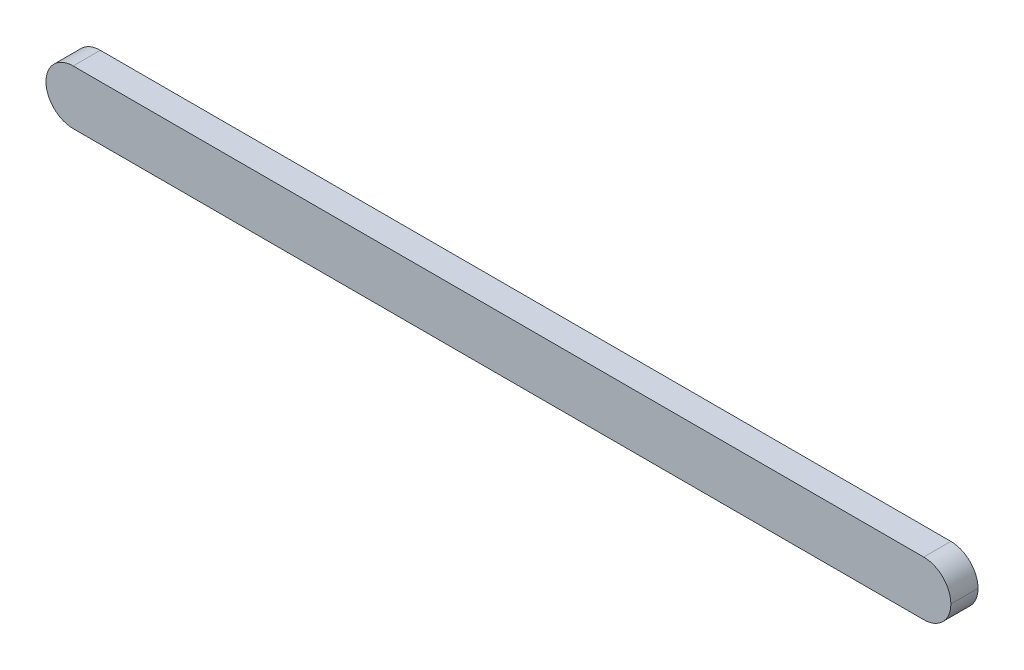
ISO-10303-21;
HEADER;
FILE_DESCRIPTION(('STEP AP214'),'2;1');
FILE_NAME('part.step','',(''),(''),'','','');
FILE_SCHEMA(('AUTOMOTIVE_DESIGN { 1 0 10303 214 1 1 1 1 }'));
ENDSEC;
DATA;
#1=APPLICATION_CONTEXT('core data for automotive mechanical design processes');
#2=APPLICATION_PROTOCOL_DEFINITION('international standard','automotive_design',2000,#1);
#3=PRODUCT_CONTEXT('',#1,'mechanical');
#4=PRODUCT('Part','Part','',(#3));
#5=PRODUCT_RELATED_PRODUCT_CATEGORY('part','',(#4));
#6=PRODUCT_DEFINITION_FORMATION('','',#4);
#7=PRODUCT_DEFINITION_CONTEXT('part definition',#1,'design');
#8=PRODUCT_DEFINITION('design','',#6,#7);
#9=PRODUCT_DEFINITION_SHAPE('','',#8);
#10=(LENGTH_UNIT() NAMED_UNIT(*) SI_UNIT(.MILLI.,.METRE.));
#11=(NAMED_UNIT(*) PLANE_ANGLE_UNIT() SI_UNIT($,.RADIAN.));
#12=(NAMED_UNIT(*) SI_UNIT($,.STERADIAN.) SOLID_ANGLE_UNIT());
#13=UNCERTAINTY_MEASURE_WITH_UNIT(LENGTH_MEASURE(1.E-05),#10,'distance_accuracy_value','');
#14=(GEOMETRIC_REPRESENTATION_CONTEXT(3) GLOBAL_UNCERTAINTY_ASSIGNED_CONTEXT((#13)) GLOBAL_UNIT_ASSIGNED_CONTEXT((#10,
#11,#12)) REPRESENTATION_CONTEXT('',''));
#15=CARTESIAN_POINT('',(0.,0.,0.));
#16=DIRECTION('',(0.,0.,1.));
#17=DIRECTION('',(1.,0.,0.));
#18=AXIS2_PLACEMENT_3D('',#15,#16,#17);
#19=CARTESIAN_POINT('',(0.,0.,3.));
#20=DIRECTION('',(0.,1.,0.));
#21=DIRECTION('',(0.,0.,1.));
#22=AXIS2_PLACEMENT_3D('',#19,#20,#21);
#23=PLANE('',#22);
#24=DIRECTION('',(1.,0.,0.));
#25=VECTOR('',#24,1.);
#26=CARTESIAN_POINT('',(0.,0.,0.));
#27=LINE('',#26,#25);
#28=CARTESIAN_POINT('',(3.,0.,0.));
#29=VERTEX_POINT('',#28);
#30=CARTESIAN_POINT('',(97.,0.,0.));
#31=VERTEX_POINT('',#30);
#32=EDGE_CURVE('E90',#29,#31,#27,.T.);
#33=ORIENTED_EDGE('',*,*,#32,.T.);
#34=DIRECTION('',(0.,0.,-1.));
#35=VECTOR('',#34,1.);
#36=CARTESIAN_POINT('',(97.,0.,3.));
#37=LINE('',#36,#35);
#38=CARTESIAN_POINT('',(97.,0.,3.));
#39=VERTEX_POINT('',#38);
#40=EDGE_CURVE('E111',#31,#39,#37,.F.);
#41=ORIENTED_EDGE('',*,*,#40,.T.);
#42=DIRECTION('',(1.,0.,0.));
#43=VECTOR('',#42,1.);
#44=CARTESIAN_POINT('',(0.,0.,3.));
#45=LINE('',#44,#43);
#46=CARTESIAN_POINT('',(3.,0.,3.));
#47=VERTEX_POINT('',#46);
#48=EDGE_CURVE('E124',#47,#39,#45,.T.);
#49=ORIENTED_EDGE('',*,*,#48,.F.);
#50=DIRECTION('',(0.,0.,-1.));
#51=VECTOR('',#50,1.);
#52=CARTESIAN_POINT('',(3.,0.,3.));
#53=LINE('',#52,#51);
#54=EDGE_CURVE('E109',#47,#29,#53,.T.);
#55=ORIENTED_EDGE('',*,*,#54,.T.);
#56=EDGE_LOOP('',(#33,#41,#49,#55));
#57=FACE_BOUND('',#56,.T.);
#58=ADVANCED_FACE('F29',(#57),#23,.F.);
#59=CARTESIAN_POINT('',(0.,6.,3.));
#60=DIRECTION('',(0.,-1.,0.));
#61=DIRECTION('',(0.,0.,-1.));
#62=AXIS2_PLACEMENT_3D('',#59,#60,#61);
#63=PLANE('',#62);
#64=DIRECTION('',(-1.,0.,0.));
#65=VECTOR('',#64,1.);
#66=CARTESIAN_POINT('',(0.,6.,3.));
#67=LINE('',#66,#65);
#68=CARTESIAN_POINT('',(97.,6.,3.));
#69=VERTEX_POINT('',#68);
#70=CARTESIAN_POINT('',(3.,6.,3.));
#71=VERTEX_POINT('',#70);
#72=EDGE_CURVE('E93',#69,#71,#67,.T.);
#73=ORIENTED_EDGE('',*,*,#72,.F.);
#74=DIRECTION('',(0.,0.,-1.));
#75=VECTOR('',#74,1.);
#76=CARTESIAN_POINT('',(97.,6.,3.));
#77=LINE('',#76,#75);
#78=CARTESIAN_POINT('',(97.,6.,0.));
#79=VERTEX_POINT('',#78);
#80=EDGE_CURVE('E11',#69,#79,#77,.T.);
#81=ORIENTED_EDGE('',*,*,#80,.T.);
#82=DIRECTION('',(-1.,0.,0.));
#83=VECTOR('',#82,1.);
#84=CARTESIAN_POINT('',(0.,6.,0.));
#85=LINE('',#84,#83);
#86=CARTESIAN_POINT('',(3.,6.,0.));
#87=VERTEX_POINT('',#86);
#88=EDGE_CURVE('E121',#79,#87,#85,.T.);
#89=ORIENTED_EDGE('',*,*,#88,.T.);
#90=DIRECTION('',(0.,0.,-1.));
#91=VECTOR('',#90,1.);
#92=CARTESIAN_POINT('',(3.,6.,3.));
#93=LINE('',#92,#91);
#94=EDGE_CURVE('E36',#87,#71,#93,.F.);
#95=ORIENTED_EDGE('',*,*,#94,.T.);
#96=EDGE_LOOP('',(#73,#81,#89,#95));
#97=FACE_BOUND('',#96,.T.);
#98=ADVANCED_FACE('F119',(#97),#63,.F.);
#99=CARTESIAN_POINT('',(0.,6.,3.));
#100=DIRECTION('',(0.,0.,-1.));
#101=DIRECTION('',(-1.,0.,0.));
#102=AXIS2_PLACEMENT_3D('',#99,#100,#101);
#103=PLANE('',#102);
#104=ORIENTED_EDGE('',*,*,#48,.T.);
#105=CARTESIAN_POINT('',(97.,3.,3.));
#106=DIRECTION('',(0.,0.,-1.));
#107=DIRECTION('',(-1.,0.,0.));
#108=AXIS2_PLACEMENT_3D('',#105,#106,#107);
#109=CIRCLE('',#108,3.);
#110=CARTESIAN_POINT('',(100.,3.,3.));
#111=VERTEX_POINT('',#110);
#112=EDGE_CURVE('E117',#39,#111,#109,.F.);
#113=ORIENTED_EDGE('',*,*,#112,.T.);
#114=CARTESIAN_POINT('',(97.,3.,3.));
#115=DIRECTION('',(0.,0.,-1.));
#116=DIRECTION('',(-1.,0.,0.));
#117=AXIS2_PLACEMENT_3D('',#114,#115,#116);
#118=CIRCLE('',#117,3.);
#119=EDGE_CURVE('E51',#111,#69,#118,.F.);
#120=ORIENTED_EDGE('',*,*,#119,.T.);
#121=ORIENTED_EDGE('',*,*,#72,.T.);
#122=CARTESIAN_POINT('',(3.,3.,3.));
#123=DIRECTION('',(0.,0.,-1.));
#124=DIRECTION('',(-1.,0.,0.));
#125=AXIS2_PLACEMENT_3D('',#122,#123,#124);
#126=CIRCLE('',#125,3.);
#127=CARTESIAN_POINT('',(0.,3.,3.));
#128=VERTEX_POINT('',#127);
#129=EDGE_CURVE('E43',#71,#128,#126,.F.);
#130=ORIENTED_EDGE('',*,*,#129,.T.);
#131=CARTESIAN_POINT('',(3.,3.,3.));
#132=DIRECTION('',(0.,0.,-1.));
#133=DIRECTION('',(-1.,0.,0.));
#134=AXIS2_PLACEMENT_3D('',#131,#132,#133);
#135=CIRCLE('',#134,3.);
#136=EDGE_CURVE('E98',#128,#47,#135,.F.);
#137=ORIENTED_EDGE('',*,*,#136,.T.);
#138=EDGE_LOOP('',(#104,#113,#120,#121,#130,#137));
#139=FACE_BOUND('',#138,.T.);
#140=ADVANCED_FACE('F123',(#139),#103,.F.);
#141=CARTESIAN_POINT('',(0.,6.,0.));
#142=DIRECTION('',(0.,0.,-1.));
#143=DIRECTION('',(-1.,0.,0.));
#144=AXIS2_PLACEMENT_3D('',#141,#142,#143);
#145=PLANE('',#144);
#146=CARTESIAN_POINT('',(97.,3.,0.));
#147=DIRECTION('',(0.,0.,-1.));
#148=DIRECTION('',(-1.,0.,0.));
#149=AXIS2_PLACEMENT_3D('',#146,#147,#148);
#150=CIRCLE('',#149,3.);
#151=CARTESIAN_POINT('',(100.,3.,0.));
#152=VERTEX_POINT('',#151);
#153=EDGE_CURVE('E102',#79,#152,#150,.T.);
#154=ORIENTED_EDGE('',*,*,#153,.T.);
#155=CARTESIAN_POINT('',(97.,3.,0.));
#156=DIRECTION('',(0.,0.,-1.));
#157=DIRECTION('',(-1.,0.,0.));
#158=AXIS2_PLACEMENT_3D('',#155,#156,#157);
#159=CIRCLE('',#158,3.);
#160=EDGE_CURVE('E104',#152,#31,#159,.T.);
#161=ORIENTED_EDGE('',*,*,#160,.T.);
#162=ORIENTED_EDGE('',*,*,#32,.F.);
#163=CARTESIAN_POINT('',(3.,3.,0.));
#164=DIRECTION('',(0.,0.,-1.));
#165=DIRECTION('',(-1.,0.,0.));
#166=AXIS2_PLACEMENT_3D('',#163,#164,#165);
#167=CIRCLE('',#166,3.);
#168=CARTESIAN_POINT('',(0.,3.,0.));
#169=VERTEX_POINT('',#168);
#170=EDGE_CURVE('E82',#29,#169,#167,.T.);
#171=ORIENTED_EDGE('',*,*,#170,.T.);
#172=CARTESIAN_POINT('',(3.,3.,0.));
#173=DIRECTION('',(0.,0.,-1.));
#174=DIRECTION('',(-1.,0.,0.));
#175=AXIS2_PLACEMENT_3D('',#172,#173,#174);
#176=CIRCLE('',#175,3.);
#177=EDGE_CURVE('E87',#169,#87,#176,.T.);
#178=ORIENTED_EDGE('',*,*,#177,.T.);
#179=ORIENTED_EDGE('',*,*,#88,.F.);
#180=EDGE_LOOP('',(#154,#161,#162,#171,#178,#179));
#181=FACE_BOUND('',#180,.T.);
#182=ADVANCED_FACE('F84',(#181),#145,.T.);
#183=CARTESIAN_POINT('',(97.,3.,3.));
#184=DIRECTION('',(0.,0.,-1.));
#185=DIRECTION('',(-1.,0.,0.));
#186=AXIS2_PLACEMENT_3D('',#183,#184,#185);
#187=CYLINDRICAL_SURFACE('',#186,3.);
#188=ORIENTED_EDGE('',*,*,#80,.F.);
#189=ORIENTED_EDGE('',*,*,#119,.F.);
#190=DIRECTION('',(0.,0.,-1.));
#191=VECTOR('',#190,1.);
#192=CARTESIAN_POINT('',(100.,3.,3.));
#193=LINE('',#192,#191);
#194=EDGE_CURVE('E99',#152,#111,#193,.F.);
#195=ORIENTED_EDGE('',*,*,#194,.F.);
#196=ORIENTED_EDGE('',*,*,#153,.F.);
#197=EDGE_LOOP('',(#188,#189,#195,#196));
#198=FACE_BOUND('',#197,.T.);
#199=ADVANCED_FACE('F137',(#198),#187,.T.);
#200=CARTESIAN_POINT('',(97.,3.,3.));
#201=DIRECTION('',(0.,0.,-1.));
#202=DIRECTION('',(-1.,0.,0.));
#203=AXIS2_PLACEMENT_3D('',#200,#201,#202);
#204=CYLINDRICAL_SURFACE('',#203,3.);
#205=ORIENTED_EDGE('',*,*,#112,.F.);
#206=ORIENTED_EDGE('',*,*,#40,.F.);
#207=ORIENTED_EDGE('',*,*,#160,.F.);
#208=ORIENTED_EDGE('',*,*,#194,.T.);
#209=EDGE_LOOP('',(#205,#206,#207,#208));
#210=FACE_BOUND('',#209,.T.);
#211=ADVANCED_FACE('F133',(#210),#204,.T.);
#212=CARTESIAN_POINT('',(3.,3.,3.));
#213=DIRECTION('',(0.,0.,-1.));
#214=DIRECTION('',(-1.,0.,0.));
#215=AXIS2_PLACEMENT_3D('',#212,#213,#214);
#216=CYLINDRICAL_SURFACE('',#215,3.);
#217=ORIENTED_EDGE('',*,*,#54,.F.);
#218=ORIENTED_EDGE('',*,*,#136,.F.);
#219=DIRECTION('',(0.,0.,-1.));
#220=VECTOR('',#219,1.);
#221=CARTESIAN_POINT('',(0.,3.,3.));
#222=LINE('',#221,#220);
#223=EDGE_CURVE('E96',#169,#128,#222,.F.);
#224=ORIENTED_EDGE('',*,*,#223,.F.);
#225=ORIENTED_EDGE('',*,*,#170,.F.);
#226=EDGE_LOOP('',(#217,#218,#224,#225));
#227=FACE_BOUND('',#226,.T.);
#228=ADVANCED_FACE('F97',(#227),#216,.T.);
#229=CARTESIAN_POINT('',(3.,3.,3.));
#230=DIRECTION('',(0.,0.,-1.));
#231=DIRECTION('',(-1.,0.,0.));
#232=AXIS2_PLACEMENT_3D('',#229,#230,#231);
#233=CYLINDRICAL_SURFACE('',#232,3.);
#234=ORIENTED_EDGE('',*,*,#129,.F.);
#235=ORIENTED_EDGE('',*,*,#94,.F.);
#236=ORIENTED_EDGE('',*,*,#177,.F.);
#237=ORIENTED_EDGE('',*,*,#223,.T.);
#238=EDGE_LOOP('',(#234,#235,#236,#237));
#239=FACE_BOUND('',#238,.T.);
#240=ADVANCED_FACE('F101',(#239),#233,.T.);
#241=CLOSED_SHELL('',(#58,#98,#140,#182,#199,#211,#228,#240));
#242=MANIFOLD_SOLID_BREP('B2',#241);
#243=ADVANCED_BREP_SHAPE_REPRESENTATION('',(#18,#242),#14);
#244=SHAPE_DEFINITION_REPRESENTATION(#9,#243);
ENDSEC;
END-ISO-10303-21;
